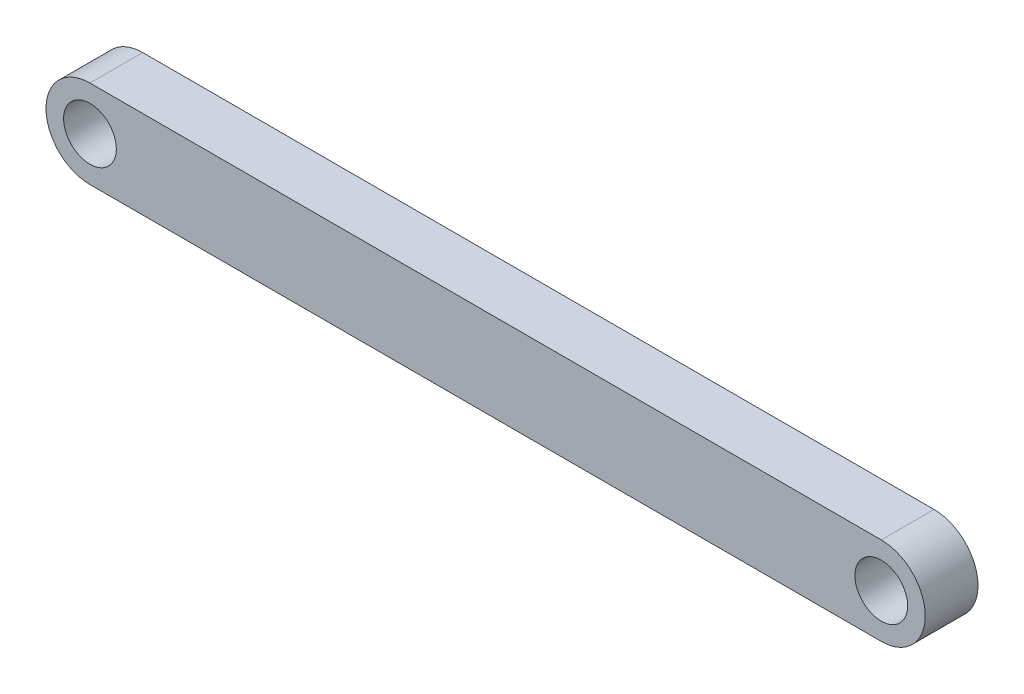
from build123d import *

# Parameters (mm, degrees)
SKETCH1_W          = 50
SKETCH1_H          = 5
EXTRUDE1_DEPTH     = 1.5
FILLET1_RADIUS     = 2.5
FILLET1_LENGTH     = 3
FILLET2_RADIUS     = 2.5
FILLET2_LENGTH     = 3
SKETCH3_R          = 1.5
CUT_EXTRUDE2_DEPTH = 51.152268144


with BuildPart() as part:
    # Sketch1 → Extrude1 (new, symmetric)
    with BuildSketch(Plane.XY):
        with Locations((25, 0)):
            Rectangle(SKETCH1_W, SKETCH1_H)
    extrude(amount=EXTRUDE1_DEPTH, both=True)

    # Fillet1: full round fillet: the end face becomes a half cylinder, R = half its width
    fillet1_face = Plane((50, 0, 0), x_dir=(0, 0, 1), z_dir=(1, 0, 0))  # on the end face: x along it, z out of the body
    fillet1_slab = fillet1_face.offset(-FILLET1_RADIUS / 2) * Box(FILLET1_LENGTH, 2 * FILLET1_RADIUS, FILLET1_RADIUS, mode=Mode.PRIVATE)  # the body's end, R deep
    fillet1_round = Plane((47.5, 0, 0), x_dir=(1, 0, 0), z_dir=(0, 0, 1)) * Cylinder(FILLET1_RADIUS, FILLET1_LENGTH, mode=Mode.PRIVATE)  # its axis R under the face
    add(fillet1_slab - fillet1_round, mode=Mode.SUBTRACT)

    # Fillet2: full round fillet: the end face becomes a half cylinder, R = half its width
    fillet2_face = Plane((0, 0, 0), x_dir=(0, 0, -1), z_dir=(-1, 0, 0))  # on the end face: x along it, z out of the body
    fillet2_slab = fillet2_face.offset(-FILLET2_RADIUS / 2) * Box(FILLET2_LENGTH, 2 * FILLET2_RADIUS, FILLET2_RADIUS, mode=Mode.PRIVATE)  # the body's end, R deep
    fillet2_round = Plane((2.5, 0, 0), x_dir=(-1, 0, 0), z_dir=(0, 0, -1)) * Cylinder(FILLET2_RADIUS, FILLET2_LENGTH, mode=Mode.PRIVATE)  # its axis R under the face
    add(fillet2_slab - fillet2_round, mode=Mode.SUBTRACT)

    # Sketch3 → Cut-Extrude2 (cut, through all)
    with BuildSketch(Plane.XY.offset(1.5)):
        with Locations((2.5, 0)):
            Circle(SKETCH3_R)
        with Locations((47.5, 0)):
            Circle(SKETCH3_R)
    extrude(amount=-CUT_EXTRUDE2_DEPTH, mode=Mode.SUBTRACT)


solid = part.part
